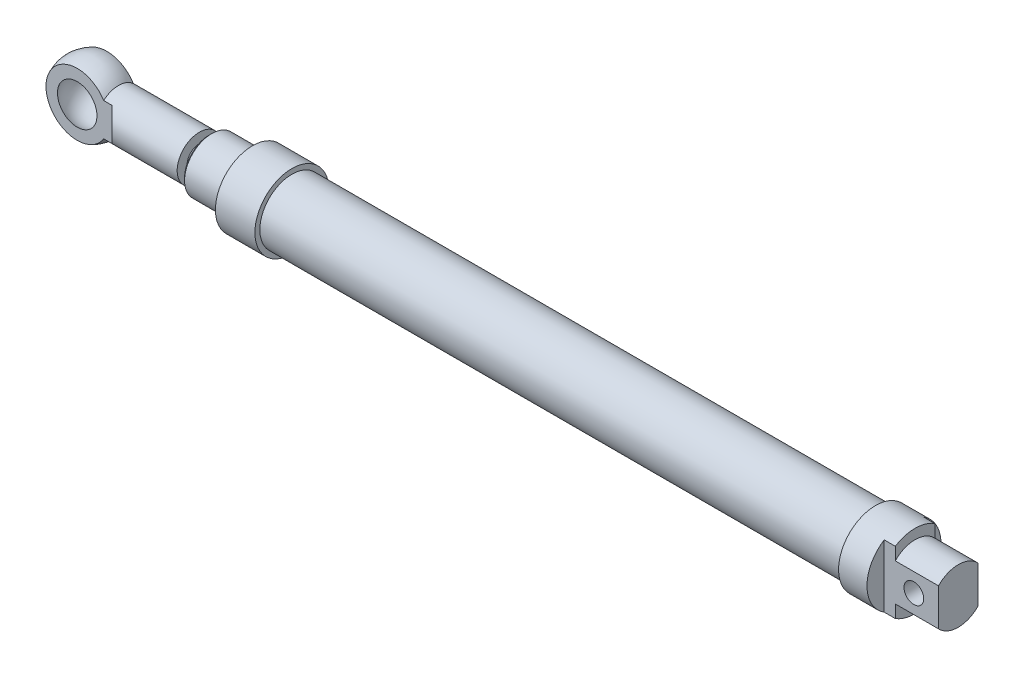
ISO-10303-21;
HEADER;
FILE_DESCRIPTION(('STEP AP214'),'2;1');
FILE_NAME('part.step','',(''),(''),'','','');
FILE_SCHEMA(('AUTOMOTIVE_DESIGN { 1 0 10303 214 1 1 1 1 }'));
ENDSEC;
DATA;
#1=APPLICATION_CONTEXT('core data for automotive mechanical design processes');
#2=APPLICATION_PROTOCOL_DEFINITION('international standard','automotive_design',2000,#1);
#3=PRODUCT_CONTEXT('',#1,'mechanical');
#4=PRODUCT('Part','Part','',(#3));
#5=PRODUCT_RELATED_PRODUCT_CATEGORY('part','',(#4));
#6=PRODUCT_DEFINITION_FORMATION('','',#4);
#7=PRODUCT_DEFINITION_CONTEXT('part definition',#1,'design');
#8=PRODUCT_DEFINITION('design','',#6,#7);
#9=PRODUCT_DEFINITION_SHAPE('','',#8);
#10=(LENGTH_UNIT() NAMED_UNIT(*) SI_UNIT(.MILLI.,.METRE.));
#11=(NAMED_UNIT(*) PLANE_ANGLE_UNIT() SI_UNIT($,.RADIAN.));
#12=(NAMED_UNIT(*) SI_UNIT($,.STERADIAN.) SOLID_ANGLE_UNIT());
#13=UNCERTAINTY_MEASURE_WITH_UNIT(LENGTH_MEASURE(1.E-05),#10,'distance_accuracy_value','');
#14=(GEOMETRIC_REPRESENTATION_CONTEXT(3) GLOBAL_UNCERTAINTY_ASSIGNED_CONTEXT((#13)) GLOBAL_UNIT_ASSIGNED_CONTEXT((#10,
#11,#12)) REPRESENTATION_CONTEXT('',''));
#15=CARTESIAN_POINT('',(0.,0.,0.));
#16=DIRECTION('',(0.,0.,1.));
#17=DIRECTION('',(1.,0.,0.));
#18=AXIS2_PLACEMENT_3D('',#15,#16,#17);
#19=CARTESIAN_POINT('',(286.,15.,0.));
#20=DIRECTION('',(1.,0.,0.));
#21=DIRECTION('',(0.,1.,0.));
#22=AXIS2_PLACEMENT_3D('',#19,#20,#21);
#23=PLANE('',#22);
#24=DIRECTION('',(0.,1.,0.));
#25=VECTOR('',#24,1.);
#26=CARTESIAN_POINT('',(286.,15.,8.));
#27=LINE('',#26,#25);
#28=CARTESIAN_POINT('',(286.,-12.6885775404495,8.));
#29=VERTEX_POINT('',#28);
#30=CARTESIAN_POINT('',(286.,-7.54983443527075,8.));
#31=VERTEX_POINT('',#30);
#32=EDGE_CURVE('E170',#29,#31,#27,.T.);
#33=ORIENTED_EDGE('',*,*,#32,.F.);
#34=CARTESIAN_POINT('',(286.,0.,0.));
#35=DIRECTION('',(1.,0.,0.));
#36=DIRECTION('',(0.,1.,0.));
#37=AXIS2_PLACEMENT_3D('',#34,#35,#36);
#38=CIRCLE('',#37,15.);
#39=CARTESIAN_POINT('',(286.,-12.6885775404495,-8.));
#40=VERTEX_POINT('',#39);
#41=EDGE_CURVE('E219',#29,#40,#38,.T.);
#42=ORIENTED_EDGE('',*,*,#41,.T.);
#43=DIRECTION('',(0.,-1.,0.));
#44=VECTOR('',#43,1.);
#45=CARTESIAN_POINT('',(286.,15.,-8.));
#46=LINE('',#45,#44);
#47=CARTESIAN_POINT('',(286.,-7.54983443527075,-8.));
#48=VERTEX_POINT('',#47);
#49=EDGE_CURVE('E186',#48,#40,#46,.T.);
#50=ORIENTED_EDGE('',*,*,#49,.F.);
#51=CARTESIAN_POINT('',(286.,0.,0.));
#52=DIRECTION('',(1.,0.,0.));
#53=DIRECTION('',(0.,1.,0.));
#54=AXIS2_PLACEMENT_3D('',#51,#52,#53);
#55=CIRCLE('',#54,11.);
#56=EDGE_CURVE('E190',#31,#48,#55,.T.);
#57=ORIENTED_EDGE('',*,*,#56,.F.);
#58=EDGE_LOOP('',(#33,#42,#50,#57));
#59=FACE_BOUND('',#58,.T.);
#60=ADVANCED_FACE('F27',(#59),#23,.T.);
#61=CARTESIAN_POINT('',(303.5,0.,0.));
#62=DIRECTION('',(1.,0.,0.));
#63=DIRECTION('',(0.,1.,0.));
#64=AXIS2_PLACEMENT_3D('',#61,#62,#63);
#65=CYLINDRICAL_SURFACE('',#64,11.);
#66=DIRECTION('',(1.,0.,0.));
#67=VECTOR('',#66,1.);
#68=CARTESIAN_POINT('',(303.5,7.54983443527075,8.));
#69=LINE('',#68,#67);
#70=CARTESIAN_POINT('',(303.5,7.54983443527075,8.));
#71=VERTEX_POINT('',#70);
#72=CARTESIAN_POINT('',(286.,7.54983443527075,8.));
#73=VERTEX_POINT('',#72);
#74=EDGE_CURVE('E232',#71,#73,#69,.F.);
#75=ORIENTED_EDGE('',*,*,#74,.F.);
#76=CARTESIAN_POINT('',(303.5,0.,0.));
#77=DIRECTION('',(1.,0.,0.));
#78=DIRECTION('',(0.,1.,0.));
#79=AXIS2_PLACEMENT_3D('',#76,#77,#78);
#80=CIRCLE('',#79,11.);
#81=CARTESIAN_POINT('',(303.5,7.54983443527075,-8.));
#82=VERTEX_POINT('',#81);
#83=EDGE_CURVE('E195',#82,#71,#80,.T.);
#84=ORIENTED_EDGE('',*,*,#83,.F.);
#85=DIRECTION('',(1.,0.,0.));
#86=VECTOR('',#85,1.);
#87=CARTESIAN_POINT('',(303.5,7.54983443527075,-8.));
#88=LINE('',#87,#86);
#89=CARTESIAN_POINT('',(286.,7.54983443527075,-8.));
#90=VERTEX_POINT('',#89);
#91=EDGE_CURVE('E223',#90,#82,#88,.T.);
#92=ORIENTED_EDGE('',*,*,#91,.F.);
#93=EDGE_CURVE('E191',#90,#73,#55,.T.);
#94=ORIENTED_EDGE('',*,*,#93,.T.);
#95=EDGE_LOOP('',(#75,#84,#92,#94));
#96=FACE_BOUND('',#95,.T.);
#97=ADVANCED_FACE('F262',(#96),#65,.T.);
#98=CARTESIAN_POINT('',(286.,12.6885775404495,8.));
#99=VERTEX_POINT('',#98);
#100=EDGE_CURVE('E173',#73,#99,#27,.T.);
#101=ORIENTED_EDGE('',*,*,#100,.F.);
#102=ORIENTED_EDGE('',*,*,#93,.F.);
#103=CARTESIAN_POINT('',(286.,12.6885775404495,-8.));
#104=VERTEX_POINT('',#103);
#105=EDGE_CURVE('E183',#104,#90,#46,.T.);
#106=ORIENTED_EDGE('',*,*,#105,.F.);
#107=EDGE_CURVE('E220',#104,#99,#38,.T.);
#108=ORIENTED_EDGE('',*,*,#107,.T.);
#109=EDGE_LOOP('',(#101,#102,#106,#108));
#110=FACE_BOUND('',#109,.T.);
#111=ADVANCED_FACE('F29',(#110),#23,.T.);
#112=CARTESIAN_POINT('',(303.5,0.,0.));
#113=DIRECTION('',(1.,0.,0.));
#114=DIRECTION('',(0.,1.,0.));
#115=AXIS2_PLACEMENT_3D('',#112,#113,#114);
#116=CYLINDRICAL_SURFACE('',#115,15.);
#117=DIRECTION('',(1.,0.,0.));
#118=VECTOR('',#117,1.);
#119=CARTESIAN_POINT('',(303.5,12.6885775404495,8.));
#120=LINE('',#119,#118);
#121=CARTESIAN_POINT('',(281.5,12.6885775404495,8.));
#122=VERTEX_POINT('',#121);
#123=EDGE_CURVE('E175',#99,#122,#120,.F.);
#124=ORIENTED_EDGE('',*,*,#123,.F.);
#125=ORIENTED_EDGE('',*,*,#107,.F.);
#126=DIRECTION('',(1.,0.,0.));
#127=VECTOR('',#126,1.);
#128=CARTESIAN_POINT('',(303.5,12.6885775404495,-8.));
#129=LINE('',#128,#127);
#130=CARTESIAN_POINT('',(281.5,12.6885775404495,-8.));
#131=VERTEX_POINT('',#130);
#132=EDGE_CURVE('E185',#131,#104,#129,.T.);
#133=ORIENTED_EDGE('',*,*,#132,.F.);
#134=CARTESIAN_POINT('',(281.5,0.,0.));
#135=DIRECTION('',(-1.,0.,0.));
#136=DIRECTION('',(0.,0.,1.));
#137=AXIS2_PLACEMENT_3D('',#134,#135,#136);
#138=CIRCLE('',#137,15.);
#139=CARTESIAN_POINT('',(281.5,-12.6885775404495,-8.));
#140=VERTEX_POINT('',#139);
#141=EDGE_CURVE('E228',#140,#131,#138,.F.);
#142=ORIENTED_EDGE('',*,*,#141,.F.);
#143=DIRECTION('',(1.,0.,0.));
#144=VECTOR('',#143,1.);
#145=CARTESIAN_POINT('',(303.5,-12.6885775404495,-8.));
#146=LINE('',#145,#144);
#147=EDGE_CURVE('E188',#40,#140,#146,.F.);
#148=ORIENTED_EDGE('',*,*,#147,.F.);
#149=ORIENTED_EDGE('',*,*,#41,.F.);
#150=DIRECTION('',(1.,0.,0.));
#151=VECTOR('',#150,1.);
#152=CARTESIAN_POINT('',(303.5,-12.6885775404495,8.));
#153=LINE('',#152,#151);
#154=CARTESIAN_POINT('',(281.5,-12.6885775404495,8.));
#155=VERTEX_POINT('',#154);
#156=EDGE_CURVE('E172',#155,#29,#153,.T.);
#157=ORIENTED_EDGE('',*,*,#156,.F.);
#158=CARTESIAN_POINT('',(281.5,0.,0.));
#159=DIRECTION('',(-1.,0.,0.));
#160=DIRECTION('',(0.,0.,1.));
#161=AXIS2_PLACEMENT_3D('',#158,#159,#160);
#162=CIRCLE('',#161,15.);
#163=EDGE_CURVE('E234',#122,#155,#162,.F.);
#164=ORIENTED_EDGE('',*,*,#163,.F.);
#165=EDGE_LOOP('',(#124,#125,#133,#142,#148,#149,#157,#164));
#166=FACE_BOUND('',#165,.T.);
#167=CARTESIAN_POINT('',(270.,0.,0.));
#168=DIRECTION('',(1.,0.,0.));
#169=DIRECTION('',(0.,1.,0.));
#170=AXIS2_PLACEMENT_3D('',#167,#168,#169);
#171=CIRCLE('',#170,15.);
#172=CARTESIAN_POINT('',(270.,15.,0.));
#173=VERTEX_POINT('',#172);
#174=EDGE_CURVE('E216',#173,#173,#171,.T.);
#175=ORIENTED_EDGE('',*,*,#174,.T.);
#176=EDGE_LOOP('',(#175));
#177=FACE_BOUND('',#176,.T.);
#178=ADVANCED_FACE('F273',(#166,#177),#116,.T.);
#179=CARTESIAN_POINT('',(270.,13.,0.));
#180=DIRECTION('',(-1.,0.,0.));
#181=DIRECTION('',(0.,-1.,0.));
#182=AXIS2_PLACEMENT_3D('',#179,#180,#181);
#183=PLANE('',#182);
#184=CARTESIAN_POINT('',(270.,0.,0.));
#185=DIRECTION('',(1.,0.,0.));
#186=DIRECTION('',(0.,1.,0.));
#187=AXIS2_PLACEMENT_3D('',#184,#185,#186);
#188=CIRCLE('',#187,13.);
#189=CARTESIAN_POINT('',(270.,13.,0.));
#190=VERTEX_POINT('',#189);
#191=EDGE_CURVE('E213',#190,#190,#188,.T.);
#192=ORIENTED_EDGE('',*,*,#191,.T.);
#193=EDGE_LOOP('',(#192));
#194=FACE_BOUND('',#193,.T.);
#195=ORIENTED_EDGE('',*,*,#174,.F.);
#196=EDGE_LOOP('',(#195));
#197=FACE_BOUND('',#196,.T.);
#198=ADVANCED_FACE('F278',(#194,#197),#183,.T.);
#199=CARTESIAN_POINT('',(303.5,0.,0.));
#200=DIRECTION('',(1.,0.,0.));
#201=DIRECTION('',(0.,1.,0.));
#202=AXIS2_PLACEMENT_3D('',#199,#200,#201);
#203=CYLINDRICAL_SURFACE('',#202,13.);
#204=CARTESIAN_POINT('',(33.5,0.,0.));
#205=DIRECTION('',(1.,0.,0.));
#206=DIRECTION('',(0.,1.,0.));
#207=AXIS2_PLACEMENT_3D('',#204,#205,#206);
#208=CIRCLE('',#207,13.);
#209=CARTESIAN_POINT('',(33.5,13.,0.));
#210=VERTEX_POINT('',#209);
#211=EDGE_CURVE('E210',#210,#210,#208,.T.);
#212=ORIENTED_EDGE('',*,*,#211,.T.);
#213=EDGE_LOOP('',(#212));
#214=FACE_BOUND('',#213,.T.);
#215=ORIENTED_EDGE('',*,*,#191,.F.);
#216=EDGE_LOOP('',(#215));
#217=FACE_BOUND('',#216,.T.);
#218=ADVANCED_FACE('F348',(#214,#217),#203,.T.);
#219=CARTESIAN_POINT('',(33.5,15.,0.));
#220=DIRECTION('',(1.,0.,0.));
#221=DIRECTION('',(0.,1.,0.));
#222=AXIS2_PLACEMENT_3D('',#219,#220,#221);
#223=PLANE('',#222);
#224=CARTESIAN_POINT('',(33.5,0.,0.));
#225=DIRECTION('',(1.,0.,0.));
#226=DIRECTION('',(0.,1.,0.));
#227=AXIS2_PLACEMENT_3D('',#224,#225,#226);
#228=CIRCLE('',#227,15.);
#229=CARTESIAN_POINT('',(33.5,15.,0.));
#230=VERTEX_POINT('',#229);
#231=EDGE_CURVE('E207',#230,#230,#228,.T.);
#232=ORIENTED_EDGE('',*,*,#231,.T.);
#233=EDGE_LOOP('',(#232));
#234=FACE_BOUND('',#233,.T.);
#235=ORIENTED_EDGE('',*,*,#211,.F.);
#236=EDGE_LOOP('',(#235));
#237=FACE_BOUND('',#236,.T.);
#238=ADVANCED_FACE('F344',(#234,#237),#223,.T.);
#239=CARTESIAN_POINT('',(303.5,0.,0.));
#240=DIRECTION('',(1.,0.,0.));
#241=DIRECTION('',(0.,1.,0.));
#242=AXIS2_PLACEMENT_3D('',#239,#240,#241);
#243=CYLINDRICAL_SURFACE('',#242,15.);
#244=CARTESIAN_POINT('',(17.5,0.,0.));
#245=DIRECTION('',(1.,0.,0.));
#246=DIRECTION('',(0.,1.,0.));
#247=AXIS2_PLACEMENT_3D('',#244,#245,#246);
#248=CIRCLE('',#247,15.);
#249=CARTESIAN_POINT('',(17.5,15.,0.));
#250=VERTEX_POINT('',#249);
#251=EDGE_CURVE('E204',#250,#250,#248,.T.);
#252=ORIENTED_EDGE('',*,*,#251,.T.);
#253=EDGE_LOOP('',(#252));
#254=FACE_BOUND('',#253,.T.);
#255=ORIENTED_EDGE('',*,*,#231,.F.);
#256=EDGE_LOOP('',(#255));
#257=FACE_BOUND('',#256,.T.);
#258=ADVANCED_FACE('F340',(#254,#257),#243,.T.);
#259=CARTESIAN_POINT('',(17.5,11.,0.));
#260=DIRECTION('',(-1.,0.,0.));
#261=DIRECTION('',(0.,-1.,0.));
#262=AXIS2_PLACEMENT_3D('',#259,#260,#261);
#263=PLANE('',#262);
#264=CARTESIAN_POINT('',(17.5,0.,0.));
#265=DIRECTION('',(1.,0.,0.));
#266=DIRECTION('',(0.,1.,0.));
#267=AXIS2_PLACEMENT_3D('',#264,#265,#266);
#268=CIRCLE('',#267,11.);
#269=CARTESIAN_POINT('',(17.5,11.,0.));
#270=VERTEX_POINT('',#269);
#271=EDGE_CURVE('E201',#270,#270,#268,.T.);
#272=ORIENTED_EDGE('',*,*,#271,.T.);
#273=EDGE_LOOP('',(#272));
#274=FACE_BOUND('',#273,.T.);
#275=ORIENTED_EDGE('',*,*,#251,.F.);
#276=EDGE_LOOP('',(#275));
#277=FACE_BOUND('',#276,.T.);
#278=ADVANCED_FACE('F337',(#274,#277),#263,.T.);
#279=CARTESIAN_POINT('',(303.5,0.,0.));
#280=DIRECTION('',(1.,0.,0.));
#281=DIRECTION('',(0.,1.,0.));
#282=AXIS2_PLACEMENT_3D('',#279,#280,#281);
#283=CYLINDRICAL_SURFACE('',#282,11.);
#284=CARTESIAN_POINT('',(1.,0.,0.));
#285=DIRECTION('',(-1.,0.,0.));
#286=DIRECTION('',(0.,-1.,0.));
#287=AXIS2_PLACEMENT_3D('',#284,#285,#286);
#288=CIRCLE('',#287,11.);
#289=CARTESIAN_POINT('',(1.,-11.,0.));
#290=VERTEX_POINT('',#289);
#291=EDGE_CURVE('E35',#290,#290,#288,.F.);
#292=ORIENTED_EDGE('',*,*,#291,.T.);
#293=EDGE_LOOP('',(#292));
#294=FACE_BOUND('',#293,.T.);
#295=ORIENTED_EDGE('',*,*,#271,.F.);
#296=EDGE_LOOP('',(#295));
#297=FACE_BOUND('',#296,.T.);
#298=ADVANCED_FACE('F333',(#294,#297),#283,.T.);
#299=CARTESIAN_POINT('',(0.,4.99999999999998,0.));
#300=DIRECTION('',(-1.,0.,0.));
#301=DIRECTION('',(0.,-1.,0.));
#302=AXIS2_PLACEMENT_3D('',#299,#300,#301);
#303=PLANE('',#302);
#304=CARTESIAN_POINT('',(0.,0.,0.));
#305=DIRECTION('',(-1.,0.,0.));
#306=DIRECTION('',(0.,-1.,0.));
#307=AXIS2_PLACEMENT_3D('',#304,#305,#306);
#308=CIRCLE('',#307,9.99999999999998);
#309=CARTESIAN_POINT('',(0.,-9.99999999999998,0.));
#310=VERTEX_POINT('',#309);
#311=EDGE_CURVE('E11',#310,#310,#308,.T.);
#312=ORIENTED_EDGE('',*,*,#311,.T.);
#313=EDGE_LOOP('',(#312));
#314=FACE_BOUND('',#313,.T.);
#315=CARTESIAN_POINT('',(0.,0.,0.));
#316=DIRECTION('',(1.,0.,0.));
#317=DIRECTION('',(0.,1.,0.));
#318=AXIS2_PLACEMENT_3D('',#315,#316,#317);
#319=CIRCLE('',#318,4.99999999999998);
#320=CARTESIAN_POINT('',(0.,4.99999999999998,0.));
#321=VERTEX_POINT('',#320);
#322=EDGE_CURVE('E198',#321,#321,#319,.T.);
#323=ORIENTED_EDGE('',*,*,#322,.T.);
#324=EDGE_LOOP('',(#323));
#325=FACE_BOUND('',#324,.T.);
#326=ADVANCED_FACE('F329',(#314,#325),#303,.T.);
#327=CARTESIAN_POINT('',(303.5,0.,0.));
#328=DIRECTION('',(1.,0.,0.));
#329=DIRECTION('',(0.,1.,0.));
#330=AXIS2_PLACEMENT_3D('',#327,#328,#329);
#331=CYLINDRICAL_SURFACE('',#330,4.99999999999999);
#332=CARTESIAN_POINT('',(-4.,0.,0.));
#333=DIRECTION('',(1.,0.,0.));
#334=DIRECTION('',(0.,0.,-1.));
#335=AXIS2_PLACEMENT_3D('',#332,#333,#334);
#336=CIRCLE('',#335,4.99999999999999);
#337=CARTESIAN_POINT('',(-4.,0.,-4.99999999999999));
#338=VERTEX_POINT('',#337);
#339=EDGE_CURVE('E236',#338,#338,#336,.F.);
#340=ORIENTED_EDGE('',*,*,#339,.F.);
#341=EDGE_LOOP('',(#340));
#342=FACE_BOUND('',#341,.T.);
#343=ORIENTED_EDGE('',*,*,#322,.F.);
#344=EDGE_LOOP('',(#343));
#345=FACE_BOUND('',#344,.T.);
#346=ADVANCED_FACE('F326',(#342,#345),#331,.T.);
#347=CARTESIAN_POINT('',(303.5,11.,0.));
#348=DIRECTION('',(1.,0.,0.));
#349=DIRECTION('',(0.,1.,0.));
#350=AXIS2_PLACEMENT_3D('',#347,#348,#349);
#351=PLANE('',#350);
#352=DIRECTION('',(0.,1.,0.));
#353=VECTOR('',#352,1.);
#354=CARTESIAN_POINT('',(303.5,11.,8.));
#355=LINE('',#354,#353);
#356=CARTESIAN_POINT('',(303.5,-7.54983443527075,8.));
#357=VERTEX_POINT('',#356);
#358=EDGE_CURVE('E168',#357,#71,#355,.T.);
#359=ORIENTED_EDGE('',*,*,#358,.F.);
#360=CARTESIAN_POINT('',(303.5,-7.54983443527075,-8.));
#361=VERTEX_POINT('',#360);
#362=EDGE_CURVE('E194',#357,#361,#80,.T.);
#363=ORIENTED_EDGE('',*,*,#362,.T.);
#364=DIRECTION('',(0.,-1.,0.));
#365=VECTOR('',#364,1.);
#366=CARTESIAN_POINT('',(303.5,11.,-8.));
#367=LINE('',#366,#365);
#368=EDGE_CURVE('E180',#82,#361,#367,.T.);
#369=ORIENTED_EDGE('',*,*,#368,.F.);
#370=ORIENTED_EDGE('',*,*,#83,.T.);
#371=EDGE_LOOP('',(#359,#363,#369,#370));
#372=FACE_BOUND('',#371,.T.);
#373=ADVANCED_FACE('F295',(#372),#351,.T.);
#374=DIRECTION('',(1.,0.,0.));
#375=VECTOR('',#374,1.);
#376=CARTESIAN_POINT('',(303.5,-7.54983443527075,8.));
#377=LINE('',#376,#375);
#378=EDGE_CURVE('E230',#31,#357,#377,.T.);
#379=ORIENTED_EDGE('',*,*,#378,.F.);
#380=ORIENTED_EDGE('',*,*,#56,.T.);
#381=DIRECTION('',(1.,0.,0.));
#382=VECTOR('',#381,1.);
#383=CARTESIAN_POINT('',(303.5,-7.54983443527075,-8.));
#384=LINE('',#383,#382);
#385=EDGE_CURVE('E225',#361,#48,#384,.F.);
#386=ORIENTED_EDGE('',*,*,#385,.F.);
#387=ORIENTED_EDGE('',*,*,#362,.F.);
#388=EDGE_LOOP('',(#379,#380,#386,#387));
#389=FACE_BOUND('',#388,.T.);
#390=ADVANCED_FACE('F270',(#389),#65,.T.);
#391=CARTESIAN_POINT('',(281.5,-15.,-18.8959301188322));
#392=DIRECTION('',(-1.,0.,0.));
#393=DIRECTION('',(0.,0.,1.));
#394=AXIS2_PLACEMENT_3D('',#391,#392,#393);
#395=PLANE('',#394);
#396=ORIENTED_EDGE('',*,*,#141,.T.);
#397=DIRECTION('',(0.,1.,0.));
#398=VECTOR('',#397,1.);
#399=CARTESIAN_POINT('',(281.5,-15.,-8.));
#400=LINE('',#399,#398);
#401=EDGE_CURVE('E177',#140,#131,#400,.T.);
#402=ORIENTED_EDGE('',*,*,#401,.F.);
#403=EDGE_LOOP('',(#396,#402));
#404=FACE_BOUND('',#403,.T.);
#405=ADVANCED_FACE('F311',(#404),#395,.F.);
#406=CARTESIAN_POINT('',(281.5,-15.,-8.));
#407=DIRECTION('',(0.,0.,1.));
#408=DIRECTION('',(1.,0.,0.));
#409=AXIS2_PLACEMENT_3D('',#406,#407,#408);
#410=PLANE('',#409);
#411=CARTESIAN_POINT('',(293.5,0.,-8.));
#412=DIRECTION('',(0.,0.,1.));
#413=DIRECTION('',(1.,0.,0.));
#414=AXIS2_PLACEMENT_3D('',#411,#412,#413);
#415=CIRCLE('',#414,3.99999999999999);
#416=CARTESIAN_POINT('',(297.5,0.,-8.));
#417=VERTEX_POINT('',#416);
#418=EDGE_CURVE('E162',#417,#417,#415,.T.);
#419=ORIENTED_EDGE('',*,*,#418,.T.);
#420=EDGE_LOOP('',(#419));
#421=FACE_BOUND('',#420,.T.);
#422=ORIENTED_EDGE('',*,*,#147,.T.);
#423=ORIENTED_EDGE('',*,*,#401,.T.);
#424=ORIENTED_EDGE('',*,*,#132,.T.);
#425=ORIENTED_EDGE('',*,*,#105,.T.);
#426=ORIENTED_EDGE('',*,*,#91,.T.);
#427=ORIENTED_EDGE('',*,*,#368,.T.);
#428=ORIENTED_EDGE('',*,*,#385,.T.);
#429=ORIENTED_EDGE('',*,*,#49,.T.);
#430=EDGE_LOOP('',(#422,#423,#424,#425,#426,#427,#428,#429));
#431=FACE_BOUND('',#430,.T.);
#432=ADVANCED_FACE('F291',(#421,#431),#410,.F.);
#433=CARTESIAN_POINT('',(281.5,-15.,18.8959301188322));
#434=DIRECTION('',(-1.,0.,0.));
#435=DIRECTION('',(0.,0.,1.));
#436=AXIS2_PLACEMENT_3D('',#433,#434,#435);
#437=PLANE('',#436);
#438=ORIENTED_EDGE('',*,*,#163,.T.);
#439=DIRECTION('',(0.,1.,0.));
#440=VECTOR('',#439,1.);
#441=CARTESIAN_POINT('',(281.5,-15.,8.));
#442=LINE('',#441,#440);
#443=EDGE_CURVE('E165',#155,#122,#442,.T.);
#444=ORIENTED_EDGE('',*,*,#443,.T.);
#445=EDGE_LOOP('',(#438,#444));
#446=FACE_BOUND('',#445,.T.);
#447=ADVANCED_FACE('F319',(#446),#437,.F.);
#448=CARTESIAN_POINT('',(281.5,-15.,8.));
#449=DIRECTION('',(0.,0.,-1.));
#450=DIRECTION('',(-1.,0.,0.));
#451=AXIS2_PLACEMENT_3D('',#448,#449,#450);
#452=PLANE('',#451);
#453=CARTESIAN_POINT('',(293.5,0.,8.));
#454=DIRECTION('',(0.,0.,1.));
#455=DIRECTION('',(1.,0.,0.));
#456=AXIS2_PLACEMENT_3D('',#453,#454,#455);
#457=CIRCLE('',#456,3.99999999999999);
#458=CARTESIAN_POINT('',(297.5,0.,8.));
#459=VERTEX_POINT('',#458);
#460=EDGE_CURVE('E159',#459,#459,#457,.T.);
#461=ORIENTED_EDGE('',*,*,#460,.F.);
#462=EDGE_LOOP('',(#461));
#463=FACE_BOUND('',#462,.T.);
#464=ORIENTED_EDGE('',*,*,#123,.T.);
#465=ORIENTED_EDGE('',*,*,#443,.F.);
#466=ORIENTED_EDGE('',*,*,#156,.T.);
#467=ORIENTED_EDGE('',*,*,#32,.T.);
#468=ORIENTED_EDGE('',*,*,#378,.T.);
#469=ORIENTED_EDGE('',*,*,#358,.T.);
#470=ORIENTED_EDGE('',*,*,#74,.T.);
#471=ORIENTED_EDGE('',*,*,#100,.T.);
#472=EDGE_LOOP('',(#464,#465,#466,#467,#468,#469,#470,#471));
#473=FACE_BOUND('',#472,.T.);
#474=ADVANCED_FACE('F421',(#463,#473),#452,.F.);
#475=CARTESIAN_POINT('',(293.5,0.,-15.));
#476=DIRECTION('',(0.,0.,1.));
#477=DIRECTION('',(1.,0.,0.));
#478=AXIS2_PLACEMENT_3D('',#475,#476,#477);
#479=CYLINDRICAL_SURFACE('',#478,3.99999999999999);
#480=ORIENTED_EDGE('',*,*,#460,.T.);
#481=EDGE_LOOP('',(#480));
#482=FACE_BOUND('',#481,.T.);
#483=ORIENTED_EDGE('',*,*,#418,.F.);
#484=EDGE_LOOP('',(#483));
#485=FACE_BOUND('',#484,.T.);
#486=ADVANCED_FACE('F428',(#482,#485),#479,.F.);
#487=CARTESIAN_POINT('',(-4.,8.99999999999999,0.));
#488=DIRECTION('',(1.,0.,0.));
#489=DIRECTION('',(0.,0.,-1.));
#490=AXIS2_PLACEMENT_3D('',#487,#488,#489);
#491=PLANE('',#490);
#492=ORIENTED_EDGE('',*,*,#339,.T.);
#493=EDGE_LOOP('',(#492));
#494=FACE_BOUND('',#493,.T.);
#495=CARTESIAN_POINT('',(-4.,0.,0.));
#496=DIRECTION('',(1.,0.,0.));
#497=DIRECTION('',(0.,0.,-1.));
#498=AXIS2_PLACEMENT_3D('',#495,#496,#497);
#499=CIRCLE('',#498,8.99999999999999);
#500=CARTESIAN_POINT('',(-4.,0.,-8.99999999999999));
#501=VERTEX_POINT('',#500);
#502=EDGE_CURVE('E156',#501,#501,#499,.T.);
#503=ORIENTED_EDGE('',*,*,#502,.T.);
#504=EDGE_LOOP('',(#503));
#505=FACE_BOUND('',#504,.T.);
#506=ADVANCED_FACE('F258',(#494,#505),#491,.T.);
#507=CARTESIAN_POINT('',(-199.414867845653,0.,0.));
#508=DIRECTION('',(1.,0.,0.));
#509=DIRECTION('',(0.,0.,-1.));
#510=AXIS2_PLACEMENT_3D('',#507,#508,#509);
#511=CYLINDRICAL_SURFACE('',#510,8.99999999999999);
#512=DIRECTION('',(1.,0.,0.));
#513=VECTOR('',#512,1.);
#514=CARTESIAN_POINT('',(-199.414867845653,6.70820393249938,5.99999999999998));
#515=LINE('',#514,#513);
#516=CARTESIAN_POINT('',(-33.4,6.7082039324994,5.99999999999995));
#517=VERTEX_POINT('',#516);
#518=CARTESIAN_POINT('',(-36.7761947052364,6.70820393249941,5.99999999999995));
#519=VERTEX_POINT('',#518);
#520=EDGE_CURVE('E42',#517,#519,#515,.F.);
#521=ORIENTED_EDGE('',*,*,#520,.F.);
#522=CARTESIAN_POINT('',(-39.3999999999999,0.,0.));
#523=DIRECTION('',(0.707106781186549,0.,-0.707106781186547));
#524=DIRECTION('',(0.707106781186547,0.,0.707106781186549));
#525=AXIS2_PLACEMENT_3D('',#522,#523,#524);
#526=ELLIPSE('',#525,12.7279220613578,8.99999999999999);
#527=CARTESIAN_POINT('',(-33.4,-6.7082039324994,5.99999999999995));
#528=VERTEX_POINT('',#527);
#529=EDGE_CURVE('E125',#528,#517,#526,.F.);
#530=ORIENTED_EDGE('',*,*,#529,.F.);
#531=DIRECTION('',(1.,0.,0.));
#532=VECTOR('',#531,1.);
#533=CARTESIAN_POINT('',(-199.414867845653,-6.70820393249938,5.99999999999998));
#534=LINE('',#533,#532);
#535=CARTESIAN_POINT('',(-36.7761947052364,-6.70820393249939,5.99999999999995));
#536=VERTEX_POINT('',#535);
#537=EDGE_CURVE('E116',#536,#528,#534,.T.);
#538=ORIENTED_EDGE('',*,*,#537,.F.);
#539=CARTESIAN_POINT('',(-36.7761947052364,0.,0.));
#540=DIRECTION('',(1.,0.,0.));
#541=DIRECTION('',(0.,0.,-1.));
#542=AXIS2_PLACEMENT_3D('',#539,#540,#541);
#543=CIRCLE('',#542,8.99999999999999);
#544=CARTESIAN_POINT('',(-36.7761947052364,-6.70820393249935,-5.99999999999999));
#545=VERTEX_POINT('',#544);
#546=EDGE_CURVE('E50',#536,#545,#543,.T.);
#547=ORIENTED_EDGE('',*,*,#546,.T.);
#548=DIRECTION('',(1.,0.,0.));
#549=VECTOR('',#548,1.);
#550=CARTESIAN_POINT('',(-199.414867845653,-6.70820393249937,-5.99999999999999));
#551=LINE('',#550,#549);
#552=CARTESIAN_POINT('',(-33.4,-6.70820393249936,-5.99999999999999));
#553=VERTEX_POINT('',#552);
#554=EDGE_CURVE('E152',#553,#545,#551,.F.);
#555=ORIENTED_EDGE('',*,*,#554,.F.);
#556=CARTESIAN_POINT('',(-39.4,0.,0.));
#557=DIRECTION('',(0.707106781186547,0.,0.707106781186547));
#558=DIRECTION('',(0.707106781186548,0.,-0.707106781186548));
#559=AXIS2_PLACEMENT_3D('',#556,#557,#558);
#560=ELLIPSE('',#559,12.7279220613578,8.99999999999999);
#561=CARTESIAN_POINT('',(-33.4,6.70820393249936,-5.99999999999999));
#562=VERTEX_POINT('',#561);
#563=EDGE_CURVE('E133',#562,#553,#560,.F.);
#564=ORIENTED_EDGE('',*,*,#563,.F.);
#565=DIRECTION('',(1.,0.,0.));
#566=VECTOR('',#565,1.);
#567=CARTESIAN_POINT('',(-199.414867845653,6.70820393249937,-5.99999999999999));
#568=LINE('',#567,#566);
#569=CARTESIAN_POINT('',(-36.7761947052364,6.70820393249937,-5.99999999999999));
#570=VERTEX_POINT('',#569);
#571=EDGE_CURVE('E150',#570,#562,#568,.T.);
#572=ORIENTED_EDGE('',*,*,#571,.F.);
#573=EDGE_CURVE('E154',#570,#519,#543,.T.);
#574=ORIENTED_EDGE('',*,*,#573,.T.);
#575=EDGE_LOOP('',(#521,#530,#538,#547,#555,#564,#572,#574));
#576=FACE_BOUND('',#575,.T.);
#577=ORIENTED_EDGE('',*,*,#502,.F.);
#578=EDGE_LOOP('',(#577));
#579=FACE_BOUND('',#578,.T.);
#580=ADVANCED_FACE('F128',(#576,#579),#511,.T.);
#581=CARTESIAN_POINT('',(-47.5,0.,0.));
#582=DIRECTION('',(1.,0.,0.));
#583=DIRECTION('',(0.,1.,0.));
#584=AXIS2_PLACEMENT_3D('',#581,#582,#583);
#585=SPHERICAL_SURFACE('',#584,14.);
#586=CARTESIAN_POINT('',(-47.5,0.,5.99999999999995));
#587=DIRECTION('',(0.,0.,-1.));
#588=DIRECTION('',(-1.,0.,0.));
#589=AXIS2_PLACEMENT_3D('',#586,#587,#588);
#590=CIRCLE('',#589,12.6491106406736);
#591=EDGE_CURVE('E120',#519,#536,#590,.F.);
#592=ORIENTED_EDGE('',*,*,#591,.F.);
#593=ORIENTED_EDGE('',*,*,#573,.F.);
#594=CARTESIAN_POINT('',(-47.5,0.,-5.99999999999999));
#595=DIRECTION('',(0.,0.,1.));
#596=DIRECTION('',(1.,0.,0.));
#597=AXIS2_PLACEMENT_3D('',#594,#595,#596);
#598=CIRCLE('',#597,12.6491106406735);
#599=EDGE_CURVE('E239',#545,#570,#598,.F.);
#600=ORIENTED_EDGE('',*,*,#599,.F.);
#601=ORIENTED_EDGE('',*,*,#546,.F.);
#602=EDGE_LOOP('',(#592,#593,#600,#601));
#603=FACE_BOUND('',#602,.T.);
#604=ADVANCED_FACE('F250',(#603),#585,.T.);
#605=CARTESIAN_POINT('',(-33.4,-15.,-5.99999999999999));
#606=DIRECTION('',(0.707106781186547,0.,0.707106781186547));
#607=DIRECTION('',(0.707106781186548,0.,-0.707106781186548));
#608=AXIS2_PLACEMENT_3D('',#605,#606,#607);
#609=PLANE('',#608);
#610=ORIENTED_EDGE('',*,*,#563,.T.);
#611=DIRECTION('',(0.,1.,0.));
#612=VECTOR('',#611,1.);
#613=CARTESIAN_POINT('',(-33.4,-15.,-5.99999999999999));
#614=LINE('',#613,#612);
#615=EDGE_CURVE('E147',#553,#562,#614,.T.);
#616=ORIENTED_EDGE('',*,*,#615,.T.);
#617=EDGE_LOOP('',(#610,#616));
#618=FACE_BOUND('',#617,.T.);
#619=ADVANCED_FACE('F243',(#618),#609,.F.);
#620=CARTESIAN_POINT('',(-277.549493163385,-15.,-5.99999999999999));
#621=DIRECTION('',(0.,0.,1.));
#622=DIRECTION('',(1.,0.,0.));
#623=AXIS2_PLACEMENT_3D('',#620,#621,#622);
#624=PLANE('',#623);
#625=CARTESIAN_POINT('',(-47.5,0.,-5.99999999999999));
#626=DIRECTION('',(0.,0.,1.));
#627=DIRECTION('',(1.,0.,0.));
#628=AXIS2_PLACEMENT_3D('',#625,#626,#627);
#629=CIRCLE('',#628,8.00000000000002);
#630=CARTESIAN_POINT('',(-39.5,0.,-5.99999999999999));
#631=VERTEX_POINT('',#630);
#632=EDGE_CURVE('E126',#631,#631,#629,.T.);
#633=ORIENTED_EDGE('',*,*,#632,.T.);
#634=EDGE_LOOP('',(#633));
#635=FACE_BOUND('',#634,.T.);
#636=ORIENTED_EDGE('',*,*,#554,.T.);
#637=ORIENTED_EDGE('',*,*,#599,.T.);
#638=ORIENTED_EDGE('',*,*,#571,.T.);
#639=ORIENTED_EDGE('',*,*,#615,.F.);
#640=EDGE_LOOP('',(#636,#637,#638,#639));
#641=FACE_BOUND('',#640,.T.);
#642=ADVANCED_FACE('F246',(#635,#641),#624,.F.);
#643=CARTESIAN_POINT('',(-277.549493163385,-15.,5.99999999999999));
#644=DIRECTION('',(0.,0.,-1.));
#645=DIRECTION('',(-1.,0.,0.));
#646=AXIS2_PLACEMENT_3D('',#643,#644,#645);
#647=PLANE('',#646);
#648=CARTESIAN_POINT('',(-47.5,0.,5.99999999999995));
#649=DIRECTION('',(0.,0.,-1.));
#650=DIRECTION('',(-1.,0.,0.));
#651=AXIS2_PLACEMENT_3D('',#648,#649,#650);
#652=CIRCLE('',#651,8.00000000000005);
#653=CARTESIAN_POINT('',(-55.5,0.,5.99999999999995));
#654=VERTEX_POINT('',#653);
#655=EDGE_CURVE('E137',#654,#654,#652,.T.);
#656=ORIENTED_EDGE('',*,*,#655,.T.);
#657=EDGE_LOOP('',(#656));
#658=FACE_BOUND('',#657,.T.);
#659=ORIENTED_EDGE('',*,*,#520,.T.);
#660=ORIENTED_EDGE('',*,*,#591,.T.);
#661=ORIENTED_EDGE('',*,*,#537,.T.);
#662=DIRECTION('',(0.,1.,0.));
#663=VECTOR('',#662,1.);
#664=CARTESIAN_POINT('',(-33.4,-15.,5.99999999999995));
#665=LINE('',#664,#663);
#666=EDGE_CURVE('E119',#528,#517,#665,.T.);
#667=ORIENTED_EDGE('',*,*,#666,.T.);
#668=EDGE_LOOP('',(#659,#660,#661,#667));
#669=FACE_BOUND('',#668,.T.);
#670=ADVANCED_FACE('F118',(#658,#669),#647,.F.);
#671=CARTESIAN_POINT('',(-33.4,-15.,5.99999999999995));
#672=DIRECTION('',(0.707106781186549,0.,-0.707106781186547));
#673=DIRECTION('',(-0.707106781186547,0.,-0.707106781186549));
#674=AXIS2_PLACEMENT_3D('',#671,#672,#673);
#675=PLANE('',#674);
#676=ORIENTED_EDGE('',*,*,#529,.T.);
#677=ORIENTED_EDGE('',*,*,#666,.F.);
#678=EDGE_LOOP('',(#676,#677));
#679=FACE_BOUND('',#678,.T.);
#680=ADVANCED_FACE('F124',(#679),#675,.F.);
#681=CARTESIAN_POINT('',(-47.5,0.,0.));
#682=DIRECTION('',(1.,0.,0.));
#683=DIRECTION('',(0.,1.,0.));
#684=AXIS2_PLACEMENT_3D('',#681,#682,#683);
#685=SPHERICAL_SURFACE('',#684,10.);
#686=CARTESIAN_POINT('',(-47.5,0.,0.));
#687=DIRECTION('',(0.,0.,-1.));
#688=DIRECTION('',(-1.,0.,0.));
#689=AXIS2_PLACEMENT_3D('',#686,#687,#688);
#690=SPHERICAL_SURFACE('',#689,10.);
#691=ORIENTED_EDGE('',*,*,#655,.F.);
#692=EDGE_LOOP('',(#691));
#693=FACE_BOUND('',#692,.T.);
#694=ORIENTED_EDGE('',*,*,#632,.F.);
#695=EDGE_LOOP('',(#694));
#696=FACE_BOUND('',#695,.T.);
#697=ADVANCED_FACE('F468',(#693,#696),#690,.F.);
#698=CARTESIAN_POINT('',(1.,0.,0.));
#699=DIRECTION('',(1.,0.,0.));
#700=DIRECTION('',(0.,1.,0.));
#701=AXIS2_PLACEMENT_3D('',#698,#699,#700);
#702=CONICAL_SURFACE('',#701,11.,0.785398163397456);
#703=ORIENTED_EDGE('',*,*,#311,.F.);
#704=EDGE_LOOP('',(#703));
#705=FACE_BOUND('',#704,.T.);
#706=ORIENTED_EDGE('',*,*,#291,.F.);
#707=EDGE_LOOP('',(#706));
#708=FACE_BOUND('',#707,.T.);
#709=ADVANCED_FACE('F474',(#705,#708),#702,.T.);
#710=CLOSED_SHELL('',(#60,#97,#111,#178,#198,#218,#238,#258,#278,#298,#326,#346,#373,#390,#405,
#432,#447,#474,#486,#506,#580,#604,#619,#642,#670,#680,#697,#709));
#711=MANIFOLD_SOLID_BREP('B2',#710);
#712=ADVANCED_BREP_SHAPE_REPRESENTATION('',(#18,#711),#14);
#713=SHAPE_DEFINITION_REPRESENTATION(#9,#712);
ENDSEC;
END-ISO-10303-21;
